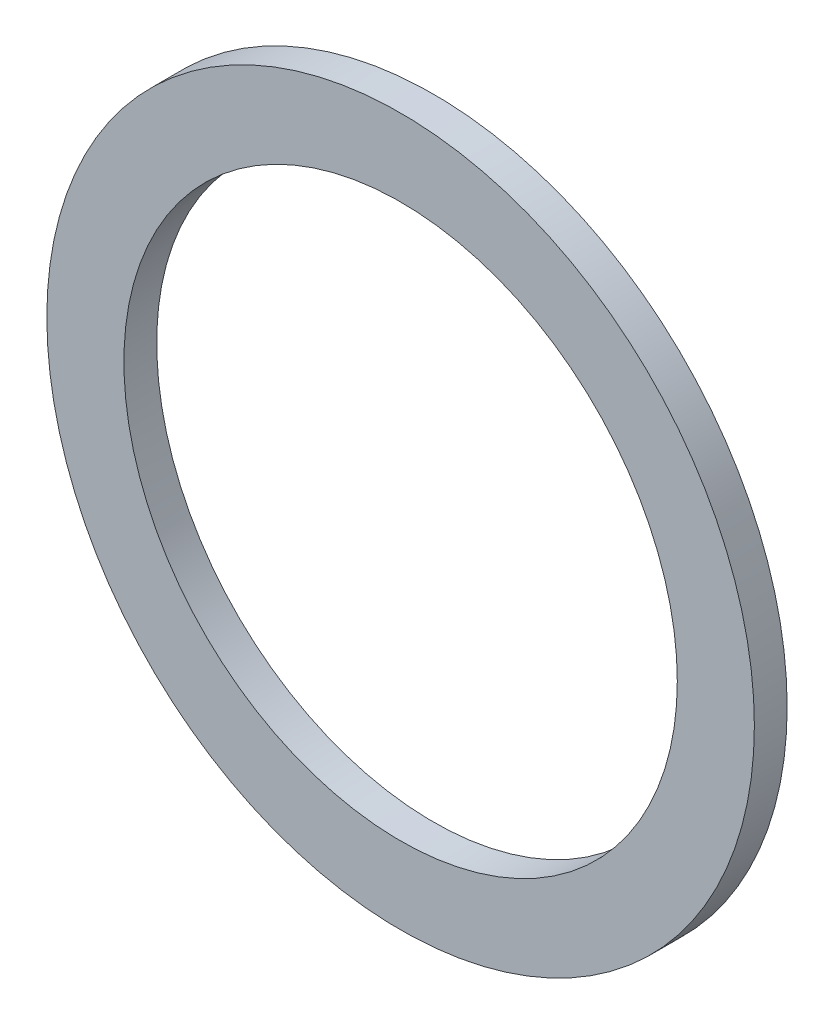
from build123d import *

# Parameters (mm, degrees)
SKETCH1_R           = 10.9601
SKETCH1_R_2         = 8.5725
EXTRUDE_THIN1_DEPTH = 1.016


with BuildPart() as part:
    # Sketch1 → Extrude-Thin1 (new body)
    with BuildSketch(Plane.XY):
        Circle(SKETCH1_R)
        Circle(SKETCH1_R_2, mode=Mode.SUBTRACT)
    extrude(amount=EXTRUDE_THIN1_DEPTH)


solid = part.part
